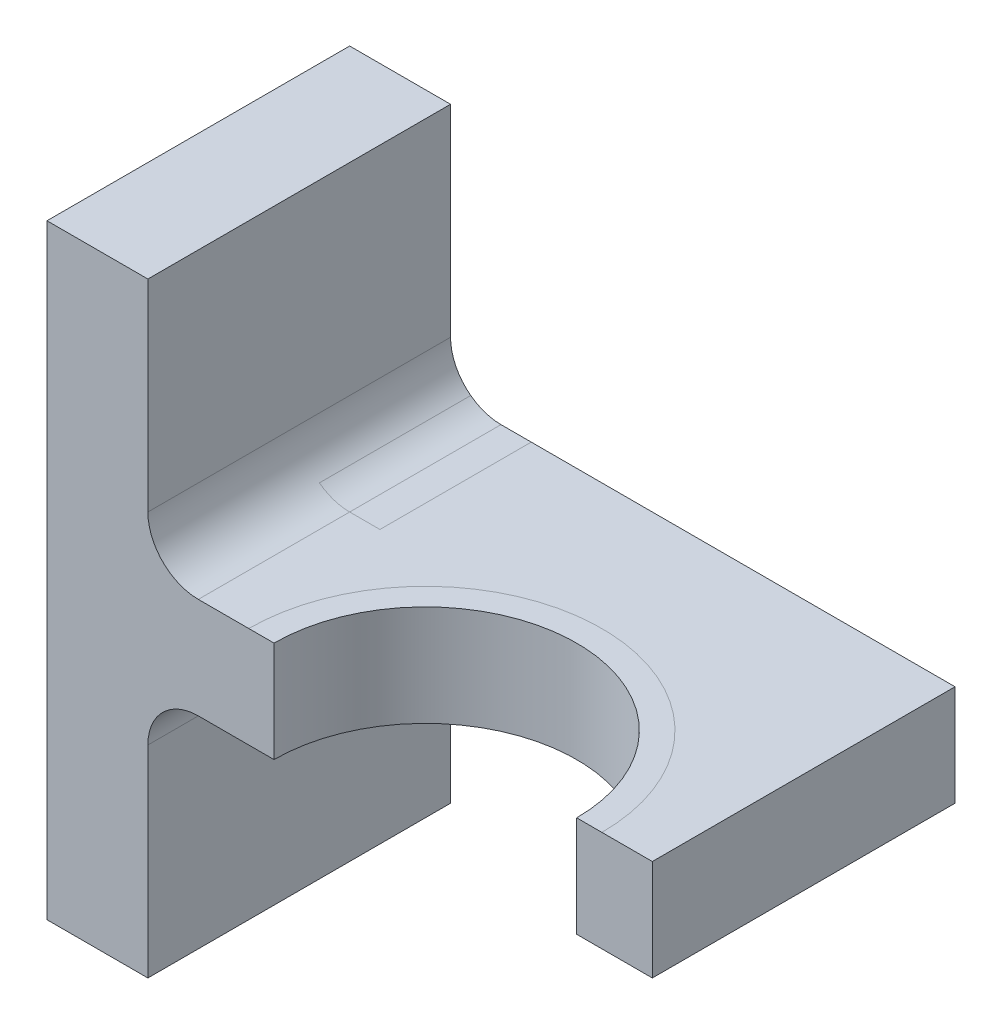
from build123d import *

# Parameters (mm, degrees)
BASE_EXTRUDE_DEPTH  = 60
FILLET1_R           = 10
EXTRUDE1_DEPTH      = 147.969384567
EXTRUDE1_DEPTH_BACK = 147.969384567
SKETCH2_R           = 30
EXTRUDE2_DEPTH      = 147.969384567
EXTRUDE2_DEPTH_BACK = 147.969384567


with BuildPart() as part:
    # Sketch1 → Base-Extrude (new, symmetric)
    with BuildSketch(Plane.XY):
        Polygon((0, -60), (20, -60), (20, -10), (120, -10), (120, 10), (20, 10), (20, 60), (0, 60), align=None)
    extrude(amount=BASE_EXTRUDE_DEPTH, both=True)

    # Fillet1
    fillet1_edges = [part.edges().sort_by_distance(p)[0] for p in [
        (20, 10, 0),
        (20, -10, 0),
    ]]
    fillet(fillet1_edges, radius=FILLET1_R)

    # Sketch2 → Extrude1 (cut, two sides: drawn at the far end of the back side and taken through both)
    with BuildSketch(Plane(origin=(0, 0, 0), x_dir=(-1, 0, 0), z_dir=(0, 1, 0)).offset(-EXTRUDE1_DEPTH_BACK)):
        with Locations(Location((-75, 0, 0), (0, 0, 90))):
            Circle(SKETCH2_R)
    extrude(amount=EXTRUDE1_DEPTH + EXTRUDE1_DEPTH_BACK, mode=Mode.SUBTRACT)

    # Sketch4 → Extrude2 (cut, two sides: drawn at the far end of the back side and taken through both)
    with BuildSketch(Plane(origin=(0, 0, 0), x_dir=(1, 0, 0), z_dir=(0, 1, 0)).offset(-EXTRUDE2_DEPTH_BACK)):
        Polygon((-315.363122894, 0), (-13.194139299, 0), (132.139721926, 0), (434.308705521, 0), (434.308705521, -604.337967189), (-315.363122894, -604.337967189), align=None)
    extrude(amount=EXTRUDE2_DEPTH + EXTRUDE2_DEPTH_BACK, mode=Mode.SUBTRACT)


solid = part.part
